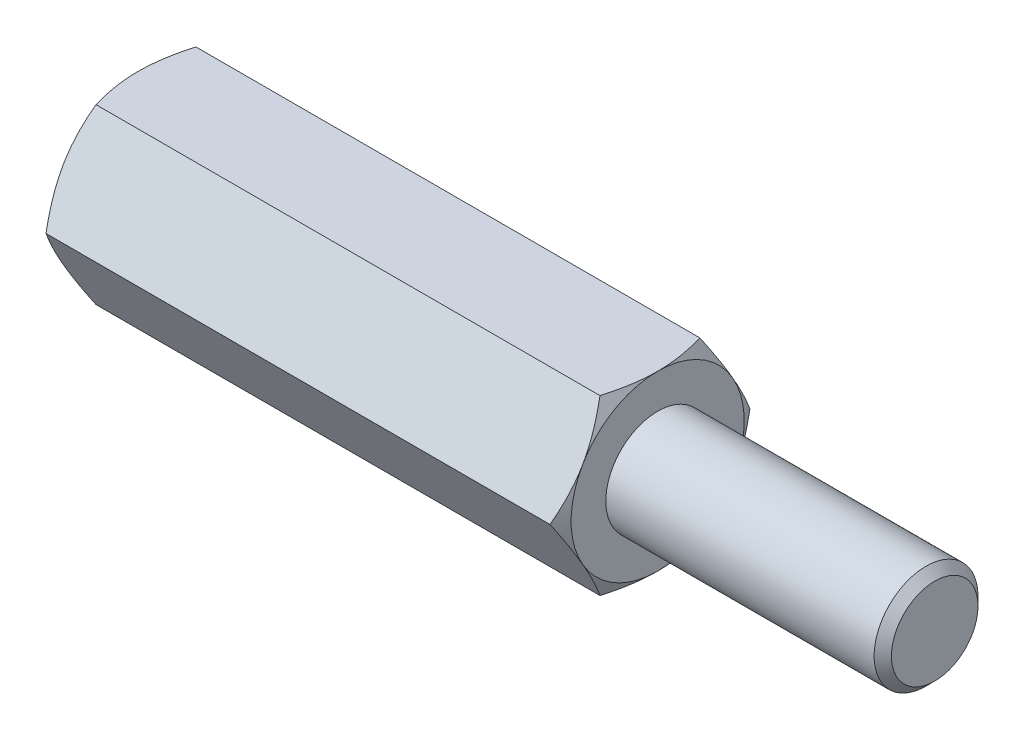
ISO-10303-21;
HEADER;
FILE_DESCRIPTION(('STEP AP214'),'2;1');
FILE_NAME('part.step','',(''),(''),'','','');
FILE_SCHEMA(('AUTOMOTIVE_DESIGN { 1 0 10303 214 1 1 1 1 }'));
ENDSEC;
DATA;
#1=APPLICATION_CONTEXT('core data for automotive mechanical design processes');
#2=APPLICATION_PROTOCOL_DEFINITION('international standard','automotive_design',2000,#1);
#3=PRODUCT_CONTEXT('',#1,'mechanical');
#4=PRODUCT('Part','Part','',(#3));
#5=PRODUCT_RELATED_PRODUCT_CATEGORY('part','',(#4));
#6=PRODUCT_DEFINITION_FORMATION('','',#4);
#7=PRODUCT_DEFINITION_CONTEXT('part definition',#1,'design');
#8=PRODUCT_DEFINITION('design','',#6,#7);
#9=PRODUCT_DEFINITION_SHAPE('','',#8);
#10=(LENGTH_UNIT() NAMED_UNIT(*) SI_UNIT(.MILLI.,.METRE.));
#11=(NAMED_UNIT(*) PLANE_ANGLE_UNIT() SI_UNIT($,.RADIAN.));
#12=(NAMED_UNIT(*) SI_UNIT($,.STERADIAN.) SOLID_ANGLE_UNIT());
#13=UNCERTAINTY_MEASURE_WITH_UNIT(LENGTH_MEASURE(1.E-05),#10,'distance_accuracy_value','');
#14=(GEOMETRIC_REPRESENTATION_CONTEXT(3) GLOBAL_UNCERTAINTY_ASSIGNED_CONTEXT((#13)) GLOBAL_UNIT_ASSIGNED_CONTEXT((#10,
#11,#12)) REPRESENTATION_CONTEXT('',''));
#15=CARTESIAN_POINT('',(0.,0.,0.));
#16=DIRECTION('',(0.,0.,1.));
#17=DIRECTION('',(1.,0.,0.));
#18=AXIS2_PLACEMENT_3D('',#15,#16,#17);
#19=CARTESIAN_POINT('',(7.5,2.5,-1.44337567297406));
#20=DIRECTION('',(1.,0.,0.));
#21=DIRECTION('',(0.,0.,-1.));
#22=AXIS2_PLACEMENT_3D('',#19,#20,#21);
#23=PLANE('',#22);
#24=CARTESIAN_POINT('',(7.5,0.,0.));
#25=DIRECTION('',(1.,0.,0.));
#26=DIRECTION('',(0.,0.,-1.));
#27=AXIS2_PLACEMENT_3D('',#24,#25,#26);
#28=CIRCLE('',#27,2.5);
#29=CARTESIAN_POINT('',(7.5,-1.25,-2.1650635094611));
#30=VERTEX_POINT('',#29);
#31=CARTESIAN_POINT('',(7.5,1.25,-2.1650635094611));
#32=VERTEX_POINT('',#31);
#33=EDGE_CURVE('E288',#30,#32,#28,.T.);
#34=ORIENTED_EDGE('',*,*,#33,.T.);
#35=CARTESIAN_POINT('',(7.5,2.5,0.));
#36=VERTEX_POINT('',#35);
#37=EDGE_CURVE('E53',#32,#36,#28,.T.);
#38=ORIENTED_EDGE('',*,*,#37,.T.);
#39=CARTESIAN_POINT('',(7.5,1.25,2.1650635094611));
#40=VERTEX_POINT('',#39);
#41=EDGE_CURVE('E295',#36,#40,#28,.T.);
#42=ORIENTED_EDGE('',*,*,#41,.T.);
#43=CARTESIAN_POINT('',(7.5,-1.25,2.1650635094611));
#44=VERTEX_POINT('',#43);
#45=EDGE_CURVE('E301',#40,#44,#28,.T.);
#46=ORIENTED_EDGE('',*,*,#45,.T.);
#47=CARTESIAN_POINT('',(7.5,0.,0.));
#48=DIRECTION('',(-1.,0.,0.));
#49=DIRECTION('',(0.,-1.,0.));
#50=AXIS2_PLACEMENT_3D('',#47,#48,#49);
#51=CIRCLE('',#50,2.5);
#52=CARTESIAN_POINT('',(7.5,-2.5,0.));
#53=VERTEX_POINT('',#52);
#54=EDGE_CURVE('E193',#53,#44,#51,.T.);
#55=ORIENTED_EDGE('',*,*,#54,.F.);
#56=EDGE_CURVE('E61',#53,#30,#28,.T.);
#57=ORIENTED_EDGE('',*,*,#56,.T.);
#58=EDGE_LOOP('',(#34,#38,#42,#46,#55,#57));
#59=FACE_BOUND('',#58,.T.);
#60=CARTESIAN_POINT('',(7.5,0.,0.));
#61=DIRECTION('',(1.,0.,0.));
#62=DIRECTION('',(0.,0.,-1.));
#63=AXIS2_PLACEMENT_3D('',#60,#61,#62);
#64=CIRCLE('',#63,1.5);
#65=CARTESIAN_POINT('',(7.5,0.,-1.5));
#66=VERTEX_POINT('',#65);
#67=EDGE_CURVE('E312',#66,#66,#64,.T.);
#68=ORIENTED_EDGE('',*,*,#67,.F.);
#69=EDGE_LOOP('',(#68));
#70=FACE_BOUND('',#69,.T.);
#71=ADVANCED_FACE('F37',(#59,#70),#23,.T.);
#72=CARTESIAN_POINT('',(7.5,0.,-2.88675134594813));
#73=DIRECTION('',(0.,-0.5,0.866025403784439));
#74=DIRECTION('',(0.,-0.866025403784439,-0.5));
#75=AXIS2_PLACEMENT_3D('',#72,#73,#74);
#76=PLANE('',#75);
#77=CARTESIAN_POINT('',(7.27664233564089,-0.000199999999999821,-2.88686681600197));
#78=CARTESIAN_POINT('',(7.31327837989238,0.109663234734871,-2.82343724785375));
#79=CARTESIAN_POINT('',(7.34659778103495,0.220474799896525,-2.75946016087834));
#80=CARTESIAN_POINT('',(7.40475771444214,0.444016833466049,-2.63039810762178));
#81=CARTESIAN_POINT('',(7.42957767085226,0.556751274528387,-2.5653108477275));
#82=CARTESIAN_POINT('',(7.46821434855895,0.780822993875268,-2.43594298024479));
#83=CARTESIAN_POINT('',(7.48228820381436,0.892125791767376,-2.37168227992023));
#84=CARTESIAN_POINT('',(7.49909084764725,1.11525522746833,-2.24285844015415));
#85=CARTESIAN_POINT('',(7.50183354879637,1.22708105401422,-2.17829576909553));
#86=CARTESIAN_POINT('',(7.49613423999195,1.43604197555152,-2.05765212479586));
#87=CARTESIAN_POINT('',(7.48909160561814,1.53320831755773,-2.0015531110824));
#88=CARTESIAN_POINT('',(7.46676858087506,1.726907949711,-1.88972057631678));
#89=CARTESIAN_POINT('',(7.45148056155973,1.82344056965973,-1.8339874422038));
#90=CARTESIAN_POINT('',(7.41326090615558,2.01753972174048,-1.7219242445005));
#91=CARTESIAN_POINT('',(7.39016722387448,2.11508168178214,-1.66560836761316));
#92=CARTESIAN_POINT('',(7.33775334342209,2.30871060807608,-1.55381665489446));
#93=CARTESIAN_POINT('',(7.30844546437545,2.40480005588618,-1.49833938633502));
#94=CARTESIAN_POINT('',(7.27664233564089,2.5002,-1.44326020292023));
#95=B_SPLINE_CURVE_WITH_KNOTS('',3,(#77,#78,#79,#80,#81,#82,#83,#84,#85,#86,#87,#88,#89,#90,#91,
#92,#93,#94),.UNSPECIFIED.,.F.,.F.,(4,2,2,2,2,2,2,2,4),(0.,0.396285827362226,0.79352433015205,
1.18093086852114,1.56786160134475,1.90479741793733,2.24204551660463,2.58677531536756,
2.93082800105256),.UNSPECIFIED.);
#96=CARTESIAN_POINT('',(7.2767090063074,0.,-2.88675134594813));
#97=VERTEX_POINT('',#96);
#98=EDGE_CURVE('E398',#97,#32,#95,.T.);
#99=ORIENTED_EDGE('',*,*,#98,.F.);
#100=DIRECTION('',(-1.,0.,0.));
#101=VECTOR('',#100,1.);
#102=CARTESIAN_POINT('',(7.5,0.,-2.88675134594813));
#103=LINE('',#102,#101);
#104=CARTESIAN_POINT('',(-7.2767090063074,0.,-2.88675134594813));
#105=VERTEX_POINT('',#104);
#106=EDGE_CURVE('E264',#97,#105,#103,.T.);
#107=ORIENTED_EDGE('',*,*,#106,.T.);
#108=CARTESIAN_POINT('',(-7.27664233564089,2.5002,-1.44326020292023));
#109=CARTESIAN_POINT('',(-7.31327837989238,2.39033676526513,-1.50668977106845));
#110=CARTESIAN_POINT('',(-7.34659778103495,2.27952520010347,-1.57066685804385));
#111=CARTESIAN_POINT('',(-7.40475771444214,2.05598316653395,-1.69972891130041));
#112=CARTESIAN_POINT('',(-7.42957767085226,1.94324872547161,-1.7648161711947));
#113=CARTESIAN_POINT('',(-7.46821434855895,1.71917700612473,-1.8941840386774));
#114=CARTESIAN_POINT('',(-7.48228820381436,1.60787420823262,-1.95844473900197));
#115=CARTESIAN_POINT('',(-7.49909084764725,1.38474477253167,-2.08726857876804));
#116=CARTESIAN_POINT('',(-7.50183354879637,1.27291894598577,-2.15183124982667));
#117=CARTESIAN_POINT('',(-7.49613423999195,1.06395802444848,-2.27247489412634));
#118=CARTESIAN_POINT('',(-7.48909160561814,0.96679168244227,-2.32857390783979));
#119=CARTESIAN_POINT('',(-7.46676858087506,0.773092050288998,-2.44040644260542));
#120=CARTESIAN_POINT('',(-7.45148056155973,0.676559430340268,-2.49613957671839));
#121=CARTESIAN_POINT('',(-7.41326090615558,0.482460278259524,-2.60820277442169));
#122=CARTESIAN_POINT('',(-7.39016722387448,0.38491831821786,-2.66451865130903));
#123=CARTESIAN_POINT('',(-7.33775334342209,0.191289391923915,-2.77631036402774));
#124=CARTESIAN_POINT('',(-7.30844546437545,0.0951999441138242,-2.83178763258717));
#125=CARTESIAN_POINT('',(-7.27664233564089,-0.000199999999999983,-2.88686681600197));
#126=B_SPLINE_CURVE_WITH_KNOTS('',3,(#108,#109,#110,#111,#112,#113,#114,#115,#116,#117,#118,
#119,#120,#121,#122,#123,#124,#125),.UNSPECIFIED.,.F.,.F.,(4,2,2,2,2,2,2,2,4),(0.,
0.396285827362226,0.79352433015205,1.18093086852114,1.56786160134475,1.90479741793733,
2.24204551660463,2.58677531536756,2.93082800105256),.UNSPECIFIED.);
#127=CARTESIAN_POINT('',(-7.5,1.25,-2.1650635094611));
#128=VERTEX_POINT('',#127);
#129=EDGE_CURVE('E377',#128,#105,#126,.T.);
#130=ORIENTED_EDGE('',*,*,#129,.F.);
#131=CARTESIAN_POINT('',(-7.2767090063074,2.5,-1.44337567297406));
#132=VERTEX_POINT('',#131);
#133=EDGE_CURVE('E317',#132,#128,#126,.T.);
#134=ORIENTED_EDGE('',*,*,#133,.F.);
#135=DIRECTION('',(-1.,0.,0.));
#136=VECTOR('',#135,1.);
#137=CARTESIAN_POINT('',(7.5,2.5,-1.44337567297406));
#138=LINE('',#137,#136);
#139=CARTESIAN_POINT('',(7.27670900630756,2.5,-1.44337567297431));
#140=VERTEX_POINT('',#139);
#141=EDGE_CURVE('E279',#140,#132,#138,.T.);
#142=ORIENTED_EDGE('',*,*,#141,.F.);
#143=EDGE_CURVE('E229',#32,#140,#95,.T.);
#144=ORIENTED_EDGE('',*,*,#143,.F.);
#145=EDGE_LOOP('',(#99,#107,#130,#134,#142,#144));
#146=FACE_BOUND('',#145,.T.);
#147=ADVANCED_FACE('F148',(#146),#76,.F.);
#148=CARTESIAN_POINT('',(7.5,2.5,-1.44337567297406));
#149=DIRECTION('',(0.,-1.,0.));
#150=DIRECTION('',(0.,0.,-1.));
#151=AXIS2_PLACEMENT_3D('',#148,#149,#150);
#152=PLANE('',#151);
#153=CARTESIAN_POINT('',(6.26803388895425,2.5,-3.90158441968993));
#154=CARTESIAN_POINT('',(6.32120772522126,2.5,-3.79217004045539));
#155=CARTESIAN_POINT('',(6.37387869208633,2.5,-3.68250707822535));
#156=CARTESIAN_POINT('',(6.47793249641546,2.5,-3.46255185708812));
#157=CARTESIAN_POINT('',(6.52931513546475,2.5,-3.35225950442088));
#158=CARTESIAN_POINT('',(6.63076309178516,2.5,-3.130356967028));
#159=CARTESIAN_POINT('',(6.68081992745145,2.5,-3.01874289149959));
#160=CARTESIAN_POINT('',(6.77891712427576,2.5,-2.79463535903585));
#161=CARTESIAN_POINT('',(6.82695757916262,2.5,-2.68214194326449));
#162=CARTESIAN_POINT('',(6.92201845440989,2.5,-2.45240385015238));
#163=CARTESIAN_POINT('',(6.96895431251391,2.5,-2.33512399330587));
#164=CARTESIAN_POINT('',(7.05933269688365,2.5,-2.09920133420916));
#165=CARTESIAN_POINT('',(7.10277483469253,2.5,-1.98055838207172));
#166=CARTESIAN_POINT('',(7.18504351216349,2.5,-1.74193489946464));
#167=CARTESIAN_POINT('',(7.22387917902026,2.5,-1.6219575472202));
#168=CARTESIAN_POINT('',(7.29570507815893,2.5,-1.38028205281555));
#169=CARTESIAN_POINT('',(7.32869712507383,2.5,-1.25858445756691));
#170=CARTESIAN_POINT('',(7.38709594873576,2.5,-1.01406369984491));
#171=CARTESIAN_POINT('',(7.41254379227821,2.5,-0.891250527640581));
#172=CARTESIAN_POINT('',(7.45442751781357,2.5,-0.64407172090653));
#173=CARTESIAN_POINT('',(7.47086432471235,2.5,-0.519706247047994));
#174=CARTESIAN_POINT('',(7.4932006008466,2.5,-0.271679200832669));
#175=CARTESIAN_POINT('',(7.49923751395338,2.5,-0.148030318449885));
#176=CARTESIAN_POINT('',(7.50062561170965,2.5,0.0993395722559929));
#177=CARTESIAN_POINT('',(7.49597656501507,2.5,0.223060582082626));
#178=CARTESIAN_POINT('',(7.47940443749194,2.5,0.432351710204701));
#179=CARTESIAN_POINT('',(7.47010665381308,2.5,0.518143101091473));
#180=CARTESIAN_POINT('',(7.44693847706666,2.5,0.689112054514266));
#181=CARTESIAN_POINT('',(7.43306748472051,2.5,0.774289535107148));
#182=CARTESIAN_POINT('',(7.38532020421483,2.5,1.02876599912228));
#183=CARTESIAN_POINT('',(7.34531764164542,2.5,1.19691958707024));
#184=CARTESIAN_POINT('',(7.25226567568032,2.5,1.53362893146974));
#185=CARTESIAN_POINT('',(7.19893620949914,2.5,1.70210423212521));
#186=CARTESIAN_POINT('',(7.11237169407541,2.5,1.95247339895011));
#187=CARTESIAN_POINT('',(7.08242477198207,2.5,2.03553184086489));
#188=CARTESIAN_POINT('',(7.02068409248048,2.5,2.20095860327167));
#189=CARTESIAN_POINT('',(6.98889037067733,2.5,2.2833269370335));
#190=CARTESIAN_POINT('',(6.90401426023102,2.5,2.49723312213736));
#191=CARTESIAN_POINT('',(6.84971733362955,2.5,2.6282879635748));
#192=CARTESIAN_POINT('',(6.73812739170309,2.5,2.88912034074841));
#193=CARTESIAN_POINT('',(6.6808341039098,2.5,3.01889775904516));
#194=CARTESIAN_POINT('',(6.56393487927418,2.5,3.27745045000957));
#195=CARTESIAN_POINT('',(6.50432825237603,2.5,3.40622540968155));
#196=CARTESIAN_POINT('',(6.38332345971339,2.5,3.66293235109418));
#197=CARTESIAN_POINT('',(6.32192524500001,2.5,3.79086430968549));
#198=CARTESIAN_POINT('',(6.1354580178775,2.5,4.17399495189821));
#199=CARTESIAN_POINT('',(6.00828249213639,2.5,4.42816724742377));
#200=CARTESIAN_POINT('',(5.75034557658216,2.5,4.93461464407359));
#201=CARTESIAN_POINT('',(5.61958483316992,2.5,5.18689007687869));
#202=CARTESIAN_POINT('',(5.36871001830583,2.5,5.66512451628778));
#203=CARTESIAN_POINT('',(5.24882986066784,2.5,5.89120644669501));
#204=CARTESIAN_POINT('',(5.00759021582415,2.5,6.34259369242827));
#205=CARTESIAN_POINT('',(4.88623065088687,2.5,6.56789896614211));
#206=CARTESIAN_POINT('',(4.64278038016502,2.5,7.01722044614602));
#207=CARTESIAN_POINT('',(4.52069305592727,2.5,7.24123848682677));
#208=CARTESIAN_POINT('',(4.27566624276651,2.5,7.68878772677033));
#209=CARTESIAN_POINT('',(4.15272681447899,2.5,7.9123189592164));
#210=CARTESIAN_POINT('',(4.02947566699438,2.5,8.13567697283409));
#211=B_SPLINE_CURVE_WITH_KNOTS('',3,(#153,#154,#155,#156,#157,#158,#159,#160,#161,#162,#163,
#164,#165,#166,#167,#168,#169,#170,#171,#172,#173,#174,#175,#176,#177,#178,#179,#180,#181,#182,
#183,#184,#185,#186,#187,#188,#189,#190,#191,#192,#193,#194,#195,#196,#197,#198,#199,#200,#201,
#202,#203,#204,#205,#206,#207,#208,#209,#210),.UNSPECIFIED.,.F.,.F.,(4,2,2,2,2,2,2,2,2,2,2,2,2,
2,2,2,2,2,2,2,2,2,2,2,2,2,2,2,4),(0.,0.364957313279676,0.729970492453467,1.09692930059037,
1.46387103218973,1.84279746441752,2.22176597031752,2.59997058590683,2.97805755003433,
3.35404692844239,3.72999770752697,4.10094071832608,4.47189175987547,4.73064905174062,
4.98944026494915,5.5072907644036,6.03710483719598,6.30196454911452,6.56681915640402,
6.99233818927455,7.41789598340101,7.84358170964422,8.26927907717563,9.12186602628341,
9.9743002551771,10.7419897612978,11.5097197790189,12.2750964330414,13.0404191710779),.UNSPECIFIED.);
#212=EDGE_CURVE('E227',#140,#36,#211,.T.);
#213=ORIENTED_EDGE('',*,*,#212,.F.);
#214=ORIENTED_EDGE('',*,*,#141,.T.);
#215=CARTESIAN_POINT('',(-6.26803388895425,2.5,-3.90158441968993));
#216=CARTESIAN_POINT('',(-6.32120772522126,2.5,-3.79217004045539));
#217=CARTESIAN_POINT('',(-6.37387869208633,2.5,-3.68250707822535));
#218=CARTESIAN_POINT('',(-6.47793249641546,2.5,-3.46255185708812));
#219=CARTESIAN_POINT('',(-6.52931513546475,2.5,-3.35225950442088));
#220=CARTESIAN_POINT('',(-6.63076309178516,2.5,-3.130356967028));
#221=CARTESIAN_POINT('',(-6.68081992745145,2.5,-3.01874289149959));
#222=CARTESIAN_POINT('',(-6.77891712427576,2.5,-2.79463535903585));
#223=CARTESIAN_POINT('',(-6.82695757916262,2.5,-2.68214194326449));
#224=CARTESIAN_POINT('',(-6.92201845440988,2.5,-2.45240385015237));
#225=CARTESIAN_POINT('',(-6.96895431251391,2.5,-2.33512399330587));
#226=CARTESIAN_POINT('',(-7.05933269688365,2.5,-2.09920133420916));
#227=CARTESIAN_POINT('',(-7.10277483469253,2.5,-1.98055838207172));
#228=CARTESIAN_POINT('',(-7.18504351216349,2.5,-1.74193489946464));
#229=CARTESIAN_POINT('',(-7.22387917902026,2.5,-1.6219575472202));
#230=CARTESIAN_POINT('',(-7.29570507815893,2.5,-1.38028205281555));
#231=CARTESIAN_POINT('',(-7.32869712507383,2.5,-1.25858445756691));
#232=CARTESIAN_POINT('',(-7.38709594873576,2.5,-1.01406369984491));
#233=CARTESIAN_POINT('',(-7.41254379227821,2.5,-0.891250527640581));
#234=CARTESIAN_POINT('',(-7.45442751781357,2.5,-0.64407172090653));
#235=CARTESIAN_POINT('',(-7.47086432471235,2.5,-0.519706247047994));
#236=CARTESIAN_POINT('',(-7.4932006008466,2.5,-0.271679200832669));
#237=CARTESIAN_POINT('',(-7.49923751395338,2.5,-0.148030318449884));
#238=CARTESIAN_POINT('',(-7.50062561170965,2.5,0.0993395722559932));
#239=CARTESIAN_POINT('',(-7.49597656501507,2.5,0.223060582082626));
#240=CARTESIAN_POINT('',(-7.47940443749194,2.5,0.432351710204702));
#241=CARTESIAN_POINT('',(-7.47010665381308,2.5,0.518143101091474));
#242=CARTESIAN_POINT('',(-7.44693847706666,2.5,0.689112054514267));
#243=CARTESIAN_POINT('',(-7.43306748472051,2.5,0.774289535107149));
#244=CARTESIAN_POINT('',(-7.38532020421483,2.5,1.02876599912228));
#245=CARTESIAN_POINT('',(-7.34531764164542,2.5,1.19691958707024));
#246=CARTESIAN_POINT('',(-7.25226567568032,2.5,1.53362893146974));
#247=CARTESIAN_POINT('',(-7.19893620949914,2.5,1.70210423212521));
#248=CARTESIAN_POINT('',(-7.11237169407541,2.5,1.95247339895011));
#249=CARTESIAN_POINT('',(-7.08242477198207,2.5,2.03553184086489));
#250=CARTESIAN_POINT('',(-7.02068409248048,2.5,2.20095860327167));
#251=CARTESIAN_POINT('',(-6.98889037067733,2.5,2.2833269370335));
#252=CARTESIAN_POINT('',(-6.90401426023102,2.5,2.49723312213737));
#253=CARTESIAN_POINT('',(-6.84971733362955,2.5,2.6282879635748));
#254=CARTESIAN_POINT('',(-6.73812739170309,2.5,2.88912034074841));
#255=CARTESIAN_POINT('',(-6.6808341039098,2.5,3.01889775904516));
#256=CARTESIAN_POINT('',(-6.56393487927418,2.5,3.27745045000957));
#257=CARTESIAN_POINT('',(-6.50432825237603,2.5,3.40622540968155));
#258=CARTESIAN_POINT('',(-6.38332345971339,2.5,3.66293235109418));
#259=CARTESIAN_POINT('',(-6.32192524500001,2.5,3.79086430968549));
#260=CARTESIAN_POINT('',(-6.1354580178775,2.5,4.17399495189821));
#261=CARTESIAN_POINT('',(-6.00828249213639,2.5,4.42816724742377));
#262=CARTESIAN_POINT('',(-5.75034557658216,2.5,4.93461464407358));
#263=CARTESIAN_POINT('',(-5.61958483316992,2.5,5.18689007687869));
#264=CARTESIAN_POINT('',(-5.36871001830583,2.5,5.66512451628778));
#265=CARTESIAN_POINT('',(-5.24882986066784,2.5,5.89120644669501));
#266=CARTESIAN_POINT('',(-5.00759021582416,2.5,6.34259369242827));
#267=CARTESIAN_POINT('',(-4.88623065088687,2.5,6.5678989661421));
#268=CARTESIAN_POINT('',(-4.64278038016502,2.5,7.01722044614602));
#269=CARTESIAN_POINT('',(-4.52069305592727,2.5,7.24123848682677));
#270=CARTESIAN_POINT('',(-4.27566624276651,2.5,7.68878772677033));
#271=CARTESIAN_POINT('',(-4.15272681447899,2.5,7.9123189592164));
#272=CARTESIAN_POINT('',(-4.02947566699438,2.5,8.13567697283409));
#273=B_SPLINE_CURVE_WITH_KNOTS('',3,(#215,#216,#217,#218,#219,#220,#221,#222,#223,#224,#225,
#226,#227,#228,#229,#230,#231,#232,#233,#234,#235,#236,#237,#238,#239,#240,#241,#242,#243,#244,
#245,#246,#247,#248,#249,#250,#251,#252,#253,#254,#255,#256,#257,#258,#259,#260,#261,#262,#263,
#264,#265,#266,#267,#268,#269,#270,#271,#272),.UNSPECIFIED.,.F.,.F.,(4,2,2,2,2,2,2,2,2,2,2,2,2,
2,2,2,2,2,2,2,2,2,2,2,2,2,2,2,4),(0.,0.364957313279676,0.729970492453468,1.09692930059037,
1.46387103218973,1.84279746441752,2.22176597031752,2.59997058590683,2.97805755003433,
3.35404692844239,3.72999770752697,4.10094071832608,4.47189175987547,4.73064905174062,
4.98944026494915,5.5072907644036,6.03710483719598,6.30196454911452,6.56681915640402,
6.99233818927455,7.41789598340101,7.84358170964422,8.26927907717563,9.12186602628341,
9.97430025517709,10.7419897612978,11.5097197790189,12.2750964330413,13.0404191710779),.UNSPECIFIED.);
#274=CARTESIAN_POINT('',(-7.5,2.5,0.));
#275=VERTEX_POINT('',#274);
#276=EDGE_CURVE('E241',#275,#132,#273,.F.);
#277=ORIENTED_EDGE('',*,*,#276,.F.);
#278=CARTESIAN_POINT('',(-7.2767090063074,2.5,1.44337567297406));
#279=VERTEX_POINT('',#278);
#280=EDGE_CURVE('E249',#279,#275,#273,.F.);
#281=ORIENTED_EDGE('',*,*,#280,.F.);
#282=DIRECTION('',(-1.,0.,0.));
#283=VECTOR('',#282,1.);
#284=CARTESIAN_POINT('',(7.5,2.5,1.44337567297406));
#285=LINE('',#284,#283);
#286=CARTESIAN_POINT('',(7.2767090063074,2.5,1.44337567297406));
#287=VERTEX_POINT('',#286);
#288=EDGE_CURVE('E276',#287,#279,#285,.T.);
#289=ORIENTED_EDGE('',*,*,#288,.F.);
#290=EDGE_CURVE('E221',#36,#287,#211,.T.);
#291=ORIENTED_EDGE('',*,*,#290,.F.);
#292=EDGE_LOOP('',(#213,#214,#277,#281,#289,#291));
#293=FACE_BOUND('',#292,.T.);
#294=ADVANCED_FACE('F153',(#293),#152,.F.);
#295=CARTESIAN_POINT('',(7.5,2.5,1.44337567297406));
#296=DIRECTION('',(0.,-0.5,-0.866025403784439));
#297=DIRECTION('',(0.,0.866025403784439,-0.5));
#298=AXIS2_PLACEMENT_3D('',#295,#296,#297);
#299=PLANE('',#298);
#300=CARTESIAN_POINT('',(7.27664233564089,2.5002,1.44326020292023));
#301=CARTESIAN_POINT('',(7.31327837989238,2.39033676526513,1.50668977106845));
#302=CARTESIAN_POINT('',(7.34659778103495,2.27952520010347,1.57066685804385));
#303=CARTESIAN_POINT('',(7.40475771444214,2.05598316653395,1.69972891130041));
#304=CARTESIAN_POINT('',(7.42957767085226,1.94324872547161,1.7648161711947));
#305=CARTESIAN_POINT('',(7.46821434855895,1.71917700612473,1.8941840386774));
#306=CARTESIAN_POINT('',(7.48228820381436,1.60787420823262,1.95844473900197));
#307=CARTESIAN_POINT('',(7.49909084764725,1.38474477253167,2.08726857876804));
#308=CARTESIAN_POINT('',(7.50183354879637,1.27291894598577,2.15183124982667));
#309=CARTESIAN_POINT('',(7.49613423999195,1.06395802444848,2.27247489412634));
#310=CARTESIAN_POINT('',(7.48909160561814,0.96679168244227,2.32857390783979));
#311=CARTESIAN_POINT('',(7.46676858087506,0.773092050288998,2.44040644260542));
#312=CARTESIAN_POINT('',(7.45148056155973,0.676559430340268,2.49613957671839));
#313=CARTESIAN_POINT('',(7.41326090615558,0.482460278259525,2.60820277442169));
#314=CARTESIAN_POINT('',(7.39016722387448,0.38491831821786,2.66451865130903));
#315=CARTESIAN_POINT('',(7.33775334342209,0.191289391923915,2.77631036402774));
#316=CARTESIAN_POINT('',(7.30844546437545,0.0951999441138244,2.83178763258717));
#317=CARTESIAN_POINT('',(7.27664233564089,-0.000199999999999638,2.88686681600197));
#318=B_SPLINE_CURVE_WITH_KNOTS('',3,(#300,#301,#302,#303,#304,#305,#306,#307,#308,#309,#310,
#311,#312,#313,#314,#315,#316,#317),.UNSPECIFIED.,.F.,.F.,(4,2,2,2,2,2,2,2,4),(0.,
0.396285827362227,0.79352433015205,1.18093086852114,1.56786160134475,1.90479741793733,
2.24204551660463,2.58677531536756,2.93082800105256),.UNSPECIFIED.);
#319=EDGE_CURVE('E228',#287,#40,#318,.T.);
#320=ORIENTED_EDGE('',*,*,#319,.F.);
#321=ORIENTED_EDGE('',*,*,#288,.T.);
#322=CARTESIAN_POINT('',(-7.27664233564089,-0.000199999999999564,2.88686681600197));
#323=CARTESIAN_POINT('',(-7.31327837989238,0.109663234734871,2.82343724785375));
#324=CARTESIAN_POINT('',(-7.34659778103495,0.220474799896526,2.75946016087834));
#325=CARTESIAN_POINT('',(-7.40475771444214,0.44401683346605,2.63039810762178));
#326=CARTESIAN_POINT('',(-7.42957767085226,0.556751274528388,2.5653108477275));
#327=CARTESIAN_POINT('',(-7.46821434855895,0.780822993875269,2.43594298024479));
#328=CARTESIAN_POINT('',(-7.48228820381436,0.892125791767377,2.37168227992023));
#329=CARTESIAN_POINT('',(-7.49909084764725,1.11525522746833,2.24285844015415));
#330=CARTESIAN_POINT('',(-7.50183354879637,1.22708105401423,2.17829576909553));
#331=CARTESIAN_POINT('',(-7.49613423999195,1.43604197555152,2.05765212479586));
#332=CARTESIAN_POINT('',(-7.48909160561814,1.53320831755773,2.0015531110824));
#333=CARTESIAN_POINT('',(-7.46676858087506,1.726907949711,1.88972057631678));
#334=CARTESIAN_POINT('',(-7.45148056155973,1.82344056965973,1.8339874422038));
#335=CARTESIAN_POINT('',(-7.41326090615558,2.01753972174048,1.7219242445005));
#336=CARTESIAN_POINT('',(-7.39016722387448,2.11508168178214,1.66560836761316));
#337=CARTESIAN_POINT('',(-7.33775334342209,2.30871060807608,1.55381665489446));
#338=CARTESIAN_POINT('',(-7.30844546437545,2.40480005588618,1.49833938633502));
#339=CARTESIAN_POINT('',(-7.27664233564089,2.5002,1.44326020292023));
#340=B_SPLINE_CURVE_WITH_KNOTS('',3,(#322,#323,#324,#325,#326,#327,#328,#329,#330,#331,#332,
#333,#334,#335,#336,#337,#338,#339),.UNSPECIFIED.,.F.,.F.,(4,2,2,2,2,2,2,2,4),(0.,
0.396285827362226,0.79352433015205,1.18093086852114,1.56786160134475,1.90479741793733,
2.24204551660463,2.58677531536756,2.93082800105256),.UNSPECIFIED.);
#341=CARTESIAN_POINT('',(-7.5,1.25,2.1650635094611));
#342=VERTEX_POINT('',#341);
#343=EDGE_CURVE('E255',#342,#279,#340,.T.);
#344=ORIENTED_EDGE('',*,*,#343,.F.);
#345=CARTESIAN_POINT('',(-7.2767090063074,0.,2.88675134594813));
#346=VERTEX_POINT('',#345);
#347=EDGE_CURVE('E262',#346,#342,#340,.T.);
#348=ORIENTED_EDGE('',*,*,#347,.F.);
#349=DIRECTION('',(-1.,0.,0.));
#350=VECTOR('',#349,1.);
#351=CARTESIAN_POINT('',(7.5,0.,2.88675134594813));
#352=LINE('',#351,#350);
#353=CARTESIAN_POINT('',(7.2767090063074,0.,2.88675134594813));
#354=VERTEX_POINT('',#353);
#355=EDGE_CURVE('E273',#354,#346,#352,.T.);
#356=ORIENTED_EDGE('',*,*,#355,.F.);
#357=EDGE_CURVE('E215',#40,#354,#318,.T.);
#358=ORIENTED_EDGE('',*,*,#357,.F.);
#359=EDGE_LOOP('',(#320,#321,#344,#348,#356,#358));
#360=FACE_BOUND('',#359,.T.);
#361=ADVANCED_FACE('F235',(#360),#299,.F.);
#362=CARTESIAN_POINT('',(7.5,0.,2.88675134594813));
#363=DIRECTION('',(0.,0.5,-0.866025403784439));
#364=DIRECTION('',(0.,0.866025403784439,0.5));
#365=AXIS2_PLACEMENT_3D('',#362,#363,#364);
#366=PLANE('',#365);
#367=CARTESIAN_POINT('',(7.27664233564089,0.000200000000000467,2.88686681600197));
#368=CARTESIAN_POINT('',(7.31327837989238,-0.109663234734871,2.82343724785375));
#369=CARTESIAN_POINT('',(7.34659778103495,-0.220474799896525,2.75946016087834));
#370=CARTESIAN_POINT('',(7.40475771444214,-0.444016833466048,2.63039810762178));
#371=CARTESIAN_POINT('',(7.42957767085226,-0.556751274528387,2.5653108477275));
#372=CARTESIAN_POINT('',(7.46821434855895,-0.780822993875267,2.43594298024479));
#373=CARTESIAN_POINT('',(7.48228820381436,-0.892125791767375,2.37168227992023));
#374=CARTESIAN_POINT('',(7.49909084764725,-1.11525522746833,2.24285844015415));
#375=CARTESIAN_POINT('',(7.50183354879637,-1.22708105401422,2.17829576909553));
#376=CARTESIAN_POINT('',(7.49613423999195,-1.43604197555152,2.05765212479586));
#377=CARTESIAN_POINT('',(7.48909160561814,-1.53320831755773,2.0015531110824));
#378=CARTESIAN_POINT('',(7.46676858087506,-1.726907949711,1.88972057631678));
#379=CARTESIAN_POINT('',(7.45148056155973,-1.82344056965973,1.8339874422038));
#380=CARTESIAN_POINT('',(7.41326090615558,-2.01753972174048,1.7219242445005));
#381=CARTESIAN_POINT('',(7.39016722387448,-2.11508168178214,1.66560836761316));
#382=CARTESIAN_POINT('',(7.33775334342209,-2.30871060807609,1.55381665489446));
#383=CARTESIAN_POINT('',(7.30844546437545,-2.40480005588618,1.49833938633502));
#384=CARTESIAN_POINT('',(7.27664233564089,-2.5002,1.44326020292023));
#385=B_SPLINE_CURVE_WITH_KNOTS('',3,(#367,#368,#369,#370,#371,#372,#373,#374,#375,#376,#377,
#378,#379,#380,#381,#382,#383,#384),.UNSPECIFIED.,.F.,.F.,(4,2,2,2,2,2,2,2,4),(0.,
0.396285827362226,0.793524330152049,1.18093086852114,1.56786160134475,1.90479741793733,
2.24204551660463,2.58677531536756,2.93082800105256),.UNSPECIFIED.);
#386=EDGE_CURVE('E321',#354,#44,#385,.T.);
#387=ORIENTED_EDGE('',*,*,#386,.F.);
#388=ORIENTED_EDGE('',*,*,#355,.T.);
#389=CARTESIAN_POINT('',(-7.27664233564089,-2.5002,1.44326020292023));
#390=CARTESIAN_POINT('',(-7.31327837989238,-2.39033676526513,1.50668977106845));
#391=CARTESIAN_POINT('',(-7.34659778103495,-2.27952520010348,1.57066685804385));
#392=CARTESIAN_POINT('',(-7.40475771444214,-2.05598316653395,1.69972891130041));
#393=CARTESIAN_POINT('',(-7.42957767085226,-1.94324872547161,1.7648161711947));
#394=CARTESIAN_POINT('',(-7.46821434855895,-1.71917700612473,1.8941840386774));
#395=CARTESIAN_POINT('',(-7.48228820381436,-1.60787420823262,1.95844473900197));
#396=CARTESIAN_POINT('',(-7.49909084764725,-1.38474477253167,2.08726857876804));
#397=CARTESIAN_POINT('',(-7.50183354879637,-1.27291894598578,2.15183124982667));
#398=CARTESIAN_POINT('',(-7.49613423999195,-1.06395802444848,2.27247489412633));
#399=CARTESIAN_POINT('',(-7.48909160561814,-0.966791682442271,2.32857390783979));
#400=CARTESIAN_POINT('',(-7.46676858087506,-0.773092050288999,2.44040644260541));
#401=CARTESIAN_POINT('',(-7.45148056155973,-0.676559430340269,2.49613957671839));
#402=CARTESIAN_POINT('',(-7.41326090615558,-0.482460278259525,2.60820277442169));
#403=CARTESIAN_POINT('',(-7.39016722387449,-0.38491831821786,2.66451865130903));
#404=CARTESIAN_POINT('',(-7.33775334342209,-0.191289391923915,2.77631036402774));
#405=CARTESIAN_POINT('',(-7.30844546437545,-0.0951999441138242,2.83178763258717));
#406=CARTESIAN_POINT('',(-7.27664233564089,0.000200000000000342,2.88686681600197));
#407=B_SPLINE_CURVE_WITH_KNOTS('',3,(#389,#390,#391,#392,#393,#394,#395,#396,#397,#398,#399,
#400,#401,#402,#403,#404,#405,#406),.UNSPECIFIED.,.F.,.F.,(4,2,2,2,2,2,2,2,4),(0.,
0.396285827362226,0.793524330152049,1.18093086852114,1.56786160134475,1.90479741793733,
2.24204551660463,2.58677531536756,2.93082800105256),.UNSPECIFIED.);
#408=CARTESIAN_POINT('',(-7.5,-1.25,2.1650635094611));
#409=VERTEX_POINT('',#408);
#410=EDGE_CURVE('E263',#409,#346,#407,.T.);
#411=ORIENTED_EDGE('',*,*,#410,.F.);
#412=CARTESIAN_POINT('',(-7.2767090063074,-2.5,1.44337567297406));
#413=VERTEX_POINT('',#412);
#414=EDGE_CURVE('E250',#413,#409,#407,.T.);
#415=ORIENTED_EDGE('',*,*,#414,.F.);
#416=DIRECTION('',(-1.,0.,0.));
#417=VECTOR('',#416,1.);
#418=CARTESIAN_POINT('',(7.5,-2.5,1.44337567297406));
#419=LINE('',#418,#417);
#420=CARTESIAN_POINT('',(7.2767090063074,-2.5,1.44337567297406));
#421=VERTEX_POINT('',#420);
#422=EDGE_CURVE('E270',#421,#413,#419,.T.);
#423=ORIENTED_EDGE('',*,*,#422,.F.);
#424=EDGE_CURVE('E210',#44,#421,#385,.T.);
#425=ORIENTED_EDGE('',*,*,#424,.F.);
#426=EDGE_LOOP('',(#387,#388,#411,#415,#423,#425));
#427=FACE_BOUND('',#426,.T.);
#428=ADVANCED_FACE('F338',(#427),#366,.F.);
#429=CARTESIAN_POINT('',(7.5,-2.5,1.44337567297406));
#430=DIRECTION('',(0.,1.,0.));
#431=DIRECTION('',(0.,0.,1.));
#432=AXIS2_PLACEMENT_3D('',#429,#430,#431);
#433=PLANE('',#432);
#434=CARTESIAN_POINT('',(6.26803388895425,-2.5,-3.90158441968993));
#435=CARTESIAN_POINT('',(6.32120772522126,-2.5,-3.79217004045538));
#436=CARTESIAN_POINT('',(6.37387869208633,-2.5,-3.68250707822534));
#437=CARTESIAN_POINT('',(6.47793249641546,-2.5,-3.46255185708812));
#438=CARTESIAN_POINT('',(6.52931513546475,-2.5,-3.35225950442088));
#439=CARTESIAN_POINT('',(6.63076309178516,-2.5,-3.130356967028));
#440=CARTESIAN_POINT('',(6.68081992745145,-2.5,-3.01874289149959));
#441=CARTESIAN_POINT('',(6.77891712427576,-2.5,-2.79463535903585));
#442=CARTESIAN_POINT('',(6.82695757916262,-2.5,-2.68214194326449));
#443=CARTESIAN_POINT('',(6.92201845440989,-2.5,-2.45240385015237));
#444=CARTESIAN_POINT('',(6.96895431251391,-2.5,-2.33512399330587));
#445=CARTESIAN_POINT('',(7.05933269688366,-2.5,-2.09920133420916));
#446=CARTESIAN_POINT('',(7.10277483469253,-2.5,-1.98055838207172));
#447=CARTESIAN_POINT('',(7.18504351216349,-2.5,-1.74193489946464));
#448=CARTESIAN_POINT('',(7.22387917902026,-2.5,-1.6219575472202));
#449=CARTESIAN_POINT('',(7.29570507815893,-2.5,-1.38028205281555));
#450=CARTESIAN_POINT('',(7.32869712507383,-2.5,-1.25858445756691));
#451=CARTESIAN_POINT('',(7.38709594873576,-2.5,-1.01406369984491));
#452=CARTESIAN_POINT('',(7.41254379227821,-2.5,-0.891250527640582));
#453=CARTESIAN_POINT('',(7.45442751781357,-2.5,-0.644071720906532));
#454=CARTESIAN_POINT('',(7.47086432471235,-2.5,-0.519706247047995));
#455=CARTESIAN_POINT('',(7.4932006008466,-2.5,-0.27167920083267));
#456=CARTESIAN_POINT('',(7.49923751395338,-2.5,-0.148030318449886));
#457=CARTESIAN_POINT('',(7.50062561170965,-2.5,0.0993395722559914));
#458=CARTESIAN_POINT('',(7.49597656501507,-2.5,0.223060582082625));
#459=CARTESIAN_POINT('',(7.47940443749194,-2.5,0.432351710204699));
#460=CARTESIAN_POINT('',(7.47010665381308,-2.5,0.518143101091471));
#461=CARTESIAN_POINT('',(7.44693847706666,-2.5,0.689112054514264));
#462=CARTESIAN_POINT('',(7.43306748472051,-2.5,0.774289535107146));
#463=CARTESIAN_POINT('',(7.38532020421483,-2.5,1.02876599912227));
#464=CARTESIAN_POINT('',(7.34531764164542,-2.5,1.19691958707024));
#465=CARTESIAN_POINT('',(7.25226567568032,-2.5,1.53362893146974));
#466=CARTESIAN_POINT('',(7.19893620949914,-2.5,1.70210423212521));
#467=CARTESIAN_POINT('',(7.11237169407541,-2.5,1.95247339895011));
#468=CARTESIAN_POINT('',(7.08242477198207,-2.5,2.03553184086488));
#469=CARTESIAN_POINT('',(7.02068409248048,-2.5,2.20095860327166));
#470=CARTESIAN_POINT('',(6.98889037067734,-2.5,2.28332693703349));
#471=CARTESIAN_POINT('',(6.90401426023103,-2.5,2.49723312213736));
#472=CARTESIAN_POINT('',(6.84971733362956,-2.5,2.6282879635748));
#473=CARTESIAN_POINT('',(6.7381273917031,-2.5,2.8891203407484));
#474=CARTESIAN_POINT('',(6.6808341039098,-2.5,3.01889775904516));
#475=CARTESIAN_POINT('',(6.56393487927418,-2.5,3.27745045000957));
#476=CARTESIAN_POINT('',(6.50432825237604,-2.5,3.40622540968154));
#477=CARTESIAN_POINT('',(6.3833234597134,-2.5,3.66293235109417));
#478=CARTESIAN_POINT('',(6.32192524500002,-2.5,3.79086430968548));
#479=CARTESIAN_POINT('',(6.1354580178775,-2.5,4.1739949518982));
#480=CARTESIAN_POINT('',(6.00828249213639,-2.5,4.42816724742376));
#481=CARTESIAN_POINT('',(5.75034557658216,-2.5,4.93461464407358));
#482=CARTESIAN_POINT('',(5.61958483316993,-2.5,5.18689007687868));
#483=CARTESIAN_POINT('',(5.36871001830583,-2.5,5.66512451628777));
#484=CARTESIAN_POINT('',(5.24882986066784,-2.5,5.891206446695));
#485=CARTESIAN_POINT('',(5.00759021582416,-2.5,6.34259369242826));
#486=CARTESIAN_POINT('',(4.88623065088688,-2.5,6.5678989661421));
#487=CARTESIAN_POINT('',(4.64278038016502,-2.5,7.01722044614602));
#488=CARTESIAN_POINT('',(4.52069305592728,-2.5,7.24123848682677));
#489=CARTESIAN_POINT('',(4.27566624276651,-2.5,7.68878772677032));
#490=CARTESIAN_POINT('',(4.15272681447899,-2.5,7.9123189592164));
#491=CARTESIAN_POINT('',(4.02947566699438,-2.5,8.13567697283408));
#492=B_SPLINE_CURVE_WITH_KNOTS('',3,(#434,#435,#436,#437,#438,#439,#440,#441,#442,#443,#444,
#445,#446,#447,#448,#449,#450,#451,#452,#453,#454,#455,#456,#457,#458,#459,#460,#461,#462,#463,
#464,#465,#466,#467,#468,#469,#470,#471,#472,#473,#474,#475,#476,#477,#478,#479,#480,#481,#482,
#483,#484,#485,#486,#487,#488,#489,#490,#491),.UNSPECIFIED.,.F.,.F.,(4,2,2,2,2,2,2,2,2,2,2,2,2,
2,2,2,2,2,2,2,2,2,2,2,2,2,2,2,4),(0.,0.364957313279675,0.729970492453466,1.09692930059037,
1.46387103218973,1.84279746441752,2.22176597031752,2.59997058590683,2.97805755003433,
3.35404692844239,3.72999770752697,4.10094071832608,4.47189175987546,4.73064905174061,
4.98944026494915,5.50729076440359,6.03710483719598,6.30196454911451,6.56681915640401,
6.99233818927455,7.417895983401,7.84358170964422,8.26927907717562,9.1218660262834,
9.97430025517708,10.7419897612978,11.5097197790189,12.2750964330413,13.0404191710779),.UNSPECIFIED.);
#493=EDGE_CURVE('E319',#421,#53,#492,.F.);
#494=ORIENTED_EDGE('',*,*,#493,.F.);
#495=ORIENTED_EDGE('',*,*,#422,.T.);
#496=CARTESIAN_POINT('',(-6.26803388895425,-2.5,-3.90158441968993));
#497=CARTESIAN_POINT('',(-6.32120772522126,-2.5,-3.79217004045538));
#498=CARTESIAN_POINT('',(-6.37387869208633,-2.5,-3.68250707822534));
#499=CARTESIAN_POINT('',(-6.47793249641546,-2.5,-3.46255185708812));
#500=CARTESIAN_POINT('',(-6.52931513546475,-2.5,-3.35225950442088));
#501=CARTESIAN_POINT('',(-6.63076309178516,-2.5,-3.130356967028));
#502=CARTESIAN_POINT('',(-6.68081992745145,-2.5,-3.01874289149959));
#503=CARTESIAN_POINT('',(-6.77891712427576,-2.5,-2.79463535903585));
#504=CARTESIAN_POINT('',(-6.82695757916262,-2.5,-2.68214194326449));
#505=CARTESIAN_POINT('',(-6.92201845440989,-2.5,-2.45240385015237));
#506=CARTESIAN_POINT('',(-6.96895431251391,-2.5,-2.33512399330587));
#507=CARTESIAN_POINT('',(-7.05933269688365,-2.5,-2.09920133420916));
#508=CARTESIAN_POINT('',(-7.10277483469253,-2.5,-1.98055838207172));
#509=CARTESIAN_POINT('',(-7.18504351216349,-2.5,-1.74193489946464));
#510=CARTESIAN_POINT('',(-7.22387917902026,-2.5,-1.6219575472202));
#511=CARTESIAN_POINT('',(-7.29570507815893,-2.5,-1.38028205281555));
#512=CARTESIAN_POINT('',(-7.32869712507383,-2.5,-1.25858445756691));
#513=CARTESIAN_POINT('',(-7.38709594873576,-2.5,-1.01406369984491));
#514=CARTESIAN_POINT('',(-7.41254379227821,-2.5,-0.891250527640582));
#515=CARTESIAN_POINT('',(-7.45442751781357,-2.5,-0.644071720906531));
#516=CARTESIAN_POINT('',(-7.47086432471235,-2.5,-0.519706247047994));
#517=CARTESIAN_POINT('',(-7.4932006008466,-2.5,-0.271679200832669));
#518=CARTESIAN_POINT('',(-7.49923751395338,-2.5,-0.148030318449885));
#519=CARTESIAN_POINT('',(-7.50062561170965,-2.5,0.0993395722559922));
#520=CARTESIAN_POINT('',(-7.49597656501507,-2.5,0.223060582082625));
#521=CARTESIAN_POINT('',(-7.47940443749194,-2.5,0.4323517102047));
#522=CARTESIAN_POINT('',(-7.47010665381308,-2.5,0.518143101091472));
#523=CARTESIAN_POINT('',(-7.44693847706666,-2.5,0.689112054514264));
#524=CARTESIAN_POINT('',(-7.43306748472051,-2.5,0.774289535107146));
#525=CARTESIAN_POINT('',(-7.38532020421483,-2.5,1.02876599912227));
#526=CARTESIAN_POINT('',(-7.34531764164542,-2.5,1.19691958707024));
#527=CARTESIAN_POINT('',(-7.25226567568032,-2.5,1.53362893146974));
#528=CARTESIAN_POINT('',(-7.19893620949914,-2.5,1.70210423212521));
#529=CARTESIAN_POINT('',(-7.11237169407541,-2.5,1.95247339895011));
#530=CARTESIAN_POINT('',(-7.08242477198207,-2.5,2.03553184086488));
#531=CARTESIAN_POINT('',(-7.02068409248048,-2.5,2.20095860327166));
#532=CARTESIAN_POINT('',(-6.98889037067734,-2.5,2.28332693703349));
#533=CARTESIAN_POINT('',(-6.90401426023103,-2.5,2.49723312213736));
#534=CARTESIAN_POINT('',(-6.84971733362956,-2.5,2.6282879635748));
#535=CARTESIAN_POINT('',(-6.7381273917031,-2.5,2.8891203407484));
#536=CARTESIAN_POINT('',(-6.6808341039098,-2.5,3.01889775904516));
#537=CARTESIAN_POINT('',(-6.56393487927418,-2.5,3.27745045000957));
#538=CARTESIAN_POINT('',(-6.50432825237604,-2.5,3.40622540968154));
#539=CARTESIAN_POINT('',(-6.3833234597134,-2.5,3.66293235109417));
#540=CARTESIAN_POINT('',(-6.32192524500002,-2.5,3.79086430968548));
#541=CARTESIAN_POINT('',(-6.1354580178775,-2.5,4.1739949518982));
#542=CARTESIAN_POINT('',(-6.00828249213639,-2.5,4.42816724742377));
#543=CARTESIAN_POINT('',(-5.75034557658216,-2.5,4.93461464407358));
#544=CARTESIAN_POINT('',(-5.61958483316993,-2.5,5.18689007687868));
#545=CARTESIAN_POINT('',(-5.36871001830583,-2.5,5.66512451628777));
#546=CARTESIAN_POINT('',(-5.24882986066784,-2.5,5.891206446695));
#547=CARTESIAN_POINT('',(-5.00759021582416,-2.5,6.34259369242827));
#548=CARTESIAN_POINT('',(-4.88623065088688,-2.5,6.5678989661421));
#549=CARTESIAN_POINT('',(-4.64278038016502,-2.5,7.01722044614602));
#550=CARTESIAN_POINT('',(-4.52069305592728,-2.5,7.24123848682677));
#551=CARTESIAN_POINT('',(-4.27566624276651,-2.5,7.68878772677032));
#552=CARTESIAN_POINT('',(-4.15272681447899,-2.5,7.9123189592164));
#553=CARTESIAN_POINT('',(-4.02947566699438,-2.5,8.13567697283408));
#554=B_SPLINE_CURVE_WITH_KNOTS('',3,(#496,#497,#498,#499,#500,#501,#502,#503,#504,#505,#506,
#507,#508,#509,#510,#511,#512,#513,#514,#515,#516,#517,#518,#519,#520,#521,#522,#523,#524,#525,
#526,#527,#528,#529,#530,#531,#532,#533,#534,#535,#536,#537,#538,#539,#540,#541,#542,#543,#544,
#545,#546,#547,#548,#549,#550,#551,#552,#553),.UNSPECIFIED.,.F.,.F.,(4,2,2,2,2,2,2,2,2,2,2,2,2,
2,2,2,2,2,2,2,2,2,2,2,2,2,2,2,4),(0.,0.364957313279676,0.729970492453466,1.09692930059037,
1.46387103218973,1.84279746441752,2.22176597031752,2.59997058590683,2.97805755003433,
3.35404692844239,3.72999770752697,4.10094071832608,4.47189175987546,4.73064905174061,
4.98944026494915,5.50729076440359,6.03710483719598,6.30196454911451,6.56681915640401,
6.99233818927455,7.417895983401,7.84358170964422,8.26927907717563,9.1218660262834,
9.97430025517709,10.7419897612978,11.5097197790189,12.2750964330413,13.0404191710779),.UNSPECIFIED.);
#555=CARTESIAN_POINT('',(-7.5,-2.5,0.));
#556=VERTEX_POINT('',#555);
#557=EDGE_CURVE('E314',#556,#413,#554,.T.);
#558=ORIENTED_EDGE('',*,*,#557,.F.);
#559=CARTESIAN_POINT('',(-7.2767090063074,-2.5,-1.44337567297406));
#560=VERTEX_POINT('',#559);
#561=EDGE_CURVE('E318',#560,#556,#554,.T.);
#562=ORIENTED_EDGE('',*,*,#561,.F.);
#563=DIRECTION('',(-1.,0.,0.));
#564=VECTOR('',#563,1.);
#565=CARTESIAN_POINT('',(7.5,-2.5,-1.44337567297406));
#566=LINE('',#565,#564);
#567=CARTESIAN_POINT('',(7.2767090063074,-2.5,-1.44337567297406));
#568=VERTEX_POINT('',#567);
#569=EDGE_CURVE('E267',#568,#560,#566,.T.);
#570=ORIENTED_EDGE('',*,*,#569,.F.);
#571=EDGE_CURVE('E195',#53,#568,#492,.F.);
#572=ORIENTED_EDGE('',*,*,#571,.F.);
#573=EDGE_LOOP('',(#494,#495,#558,#562,#570,#572));
#574=FACE_BOUND('',#573,.T.);
#575=ADVANCED_FACE('F172',(#574),#433,.F.);
#576=CARTESIAN_POINT('',(7.5,-2.5,-1.44337567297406));
#577=DIRECTION('',(0.,0.5,0.866025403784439));
#578=DIRECTION('',(0.,-0.866025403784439,0.5));
#579=AXIS2_PLACEMENT_3D('',#576,#577,#578);
#580=PLANE('',#579);
#581=CARTESIAN_POINT('',(7.27664233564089,-2.5002,-1.44326020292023));
#582=CARTESIAN_POINT('',(7.31327837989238,-2.39033676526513,-1.50668977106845));
#583=CARTESIAN_POINT('',(7.34659778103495,-2.27952520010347,-1.57066685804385));
#584=CARTESIAN_POINT('',(7.40475771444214,-2.05598316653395,-1.69972891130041));
#585=CARTESIAN_POINT('',(7.42957767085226,-1.94324872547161,-1.7648161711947));
#586=CARTESIAN_POINT('',(7.46821434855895,-1.71917700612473,-1.8941840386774));
#587=CARTESIAN_POINT('',(7.48228820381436,-1.60787420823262,-1.95844473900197));
#588=CARTESIAN_POINT('',(7.49909084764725,-1.38474477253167,-2.08726857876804));
#589=CARTESIAN_POINT('',(7.50183354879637,-1.27291894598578,-2.15183124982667));
#590=CARTESIAN_POINT('',(7.49613423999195,-1.06395802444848,-2.27247489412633));
#591=CARTESIAN_POINT('',(7.48909160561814,-0.966791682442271,-2.32857390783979));
#592=CARTESIAN_POINT('',(7.46676858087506,-0.773092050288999,-2.44040644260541));
#593=CARTESIAN_POINT('',(7.45148056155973,-0.676559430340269,-2.49613957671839));
#594=CARTESIAN_POINT('',(7.41326090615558,-0.482460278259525,-2.60820277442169));
#595=CARTESIAN_POINT('',(7.39016722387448,-0.38491831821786,-2.66451865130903));
#596=CARTESIAN_POINT('',(7.33775334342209,-0.191289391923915,-2.77631036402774));
#597=CARTESIAN_POINT('',(7.30844546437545,-0.095199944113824,-2.83178763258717));
#598=CARTESIAN_POINT('',(7.27664233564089,0.000200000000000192,-2.88686681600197));
#599=B_SPLINE_CURVE_WITH_KNOTS('',3,(#581,#582,#583,#584,#585,#586,#587,#588,#589,#590,#591,
#592,#593,#594,#595,#596,#597,#598),.UNSPECIFIED.,.F.,.F.,(4,2,2,2,2,2,2,2,4),(0.,
0.396285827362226,0.793524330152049,1.18093086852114,1.56786160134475,1.90479741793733,
2.24204551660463,2.58677531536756,2.93082800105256),.UNSPECIFIED.);
#600=EDGE_CURVE('E192',#568,#30,#599,.T.);
#601=ORIENTED_EDGE('',*,*,#600,.F.);
#602=ORIENTED_EDGE('',*,*,#569,.T.);
#603=CARTESIAN_POINT('',(-7.27664233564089,0.000200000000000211,-2.88686681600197));
#604=CARTESIAN_POINT('',(-7.31327837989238,-0.109663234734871,-2.82343724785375));
#605=CARTESIAN_POINT('',(-7.34659778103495,-0.220474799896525,-2.75946016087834));
#606=CARTESIAN_POINT('',(-7.40475771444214,-0.444016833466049,-2.63039810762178));
#607=CARTESIAN_POINT('',(-7.42957767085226,-0.556751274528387,-2.5653108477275));
#608=CARTESIAN_POINT('',(-7.46821434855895,-0.780822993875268,-2.43594298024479));
#609=CARTESIAN_POINT('',(-7.48228820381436,-0.892125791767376,-2.37168227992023));
#610=CARTESIAN_POINT('',(-7.49909084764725,-1.11525522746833,-2.24285844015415));
#611=CARTESIAN_POINT('',(-7.50183354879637,-1.22708105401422,-2.17829576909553));
#612=CARTESIAN_POINT('',(-7.49613423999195,-1.43604197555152,-2.05765212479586));
#613=CARTESIAN_POINT('',(-7.48909160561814,-1.53320831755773,-2.0015531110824));
#614=CARTESIAN_POINT('',(-7.46676858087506,-1.726907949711,-1.88972057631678));
#615=CARTESIAN_POINT('',(-7.45148056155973,-1.82344056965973,-1.8339874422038));
#616=CARTESIAN_POINT('',(-7.41326090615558,-2.01753972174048,-1.7219242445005));
#617=CARTESIAN_POINT('',(-7.39016722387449,-2.11508168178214,-1.66560836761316));
#618=CARTESIAN_POINT('',(-7.33775334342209,-2.30871060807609,-1.55381665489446));
#619=CARTESIAN_POINT('',(-7.30844546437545,-2.40480005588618,-1.49833938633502));
#620=CARTESIAN_POINT('',(-7.27664233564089,-2.5002,-1.44326020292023));
#621=B_SPLINE_CURVE_WITH_KNOTS('',3,(#603,#604,#605,#606,#607,#608,#609,#610,#611,#612,#613,
#614,#615,#616,#617,#618,#619,#620),.UNSPECIFIED.,.F.,.F.,(4,2,2,2,2,2,2,2,4),(0.,
0.396285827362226,0.79352433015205,1.18093086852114,1.56786160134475,1.90479741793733,
2.24204551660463,2.58677531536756,2.93082800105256),.UNSPECIFIED.);
#622=CARTESIAN_POINT('',(-7.5,-1.25,-2.1650635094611));
#623=VERTEX_POINT('',#622);
#624=EDGE_CURVE('E178',#623,#560,#621,.T.);
#625=ORIENTED_EDGE('',*,*,#624,.F.);
#626=EDGE_CURVE('E387',#105,#623,#621,.T.);
#627=ORIENTED_EDGE('',*,*,#626,.F.);
#628=ORIENTED_EDGE('',*,*,#106,.F.);
#629=EDGE_CURVE('E185',#30,#97,#599,.T.);
#630=ORIENTED_EDGE('',*,*,#629,.F.);
#631=EDGE_LOOP('',(#601,#602,#625,#627,#628,#630));
#632=FACE_BOUND('',#631,.T.);
#633=ADVANCED_FACE('F167',(#632),#580,.F.);
#634=CARTESIAN_POINT('',(-7.5,0.,0.));
#635=DIRECTION('',(1.,0.,0.));
#636=DIRECTION('',(0.,1.,0.));
#637=AXIS2_PLACEMENT_3D('',#634,#635,#636);
#638=CONICAL_SURFACE('',#637,2.5,1.0471975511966);
#639=ORIENTED_EDGE('',*,*,#129,.T.);
#640=ORIENTED_EDGE('',*,*,#626,.T.);
#641=CARTESIAN_POINT('',(-7.5,0.,0.));
#642=DIRECTION('',(1.,0.,0.));
#643=DIRECTION('',(0.,0.,-1.));
#644=AXIS2_PLACEMENT_3D('',#641,#642,#643);
#645=CIRCLE('',#644,2.5);
#646=EDGE_CURVE('E282',#623,#128,#645,.T.);
#647=ORIENTED_EDGE('',*,*,#646,.T.);
#648=EDGE_LOOP('',(#639,#640,#647));
#649=FACE_BOUND('',#648,.T.);
#650=ADVANCED_FACE('F171',(#649),#638,.T.);
#651=ORIENTED_EDGE('',*,*,#561,.T.);
#652=EDGE_CURVE('E286',#556,#623,#645,.T.);
#653=ORIENTED_EDGE('',*,*,#652,.T.);
#654=ORIENTED_EDGE('',*,*,#624,.T.);
#655=EDGE_LOOP('',(#651,#653,#654));
#656=FACE_BOUND('',#655,.T.);
#657=ADVANCED_FACE('F409',(#656),#638,.T.);
#658=ORIENTED_EDGE('',*,*,#414,.T.);
#659=CARTESIAN_POINT('',(-7.5,0.,0.));
#660=DIRECTION('',(-1.,0.,0.));
#661=DIRECTION('',(0.,-1.,0.));
#662=AXIS2_PLACEMENT_3D('',#659,#660,#661);
#663=CIRCLE('',#662,2.5);
#664=EDGE_CURVE('E395',#556,#409,#663,.T.);
#665=ORIENTED_EDGE('',*,*,#664,.F.);
#666=ORIENTED_EDGE('',*,*,#557,.T.);
#667=EDGE_LOOP('',(#658,#665,#666));
#668=FACE_BOUND('',#667,.T.);
#669=ADVANCED_FACE('F414',(#668),#638,.T.);
#670=ORIENTED_EDGE('',*,*,#347,.T.);
#671=EDGE_CURVE('E370',#342,#409,#645,.T.);
#672=ORIENTED_EDGE('',*,*,#671,.T.);
#673=ORIENTED_EDGE('',*,*,#410,.T.);
#674=EDGE_LOOP('',(#670,#672,#673));
#675=FACE_BOUND('',#674,.T.);
#676=ADVANCED_FACE('F158',(#675),#638,.T.);
#677=ORIENTED_EDGE('',*,*,#343,.T.);
#678=ORIENTED_EDGE('',*,*,#280,.T.);
#679=EDGE_CURVE('E358',#275,#342,#645,.T.);
#680=ORIENTED_EDGE('',*,*,#679,.T.);
#681=EDGE_LOOP('',(#677,#678,#680));
#682=FACE_BOUND('',#681,.T.);
#683=ADVANCED_FACE('F356',(#682),#638,.T.);
#684=ORIENTED_EDGE('',*,*,#276,.T.);
#685=ORIENTED_EDGE('',*,*,#133,.T.);
#686=EDGE_CURVE('E287',#128,#275,#645,.T.);
#687=ORIENTED_EDGE('',*,*,#686,.T.);
#688=EDGE_LOOP('',(#684,#685,#687));
#689=FACE_BOUND('',#688,.T.);
#690=ADVANCED_FACE('F165',(#689),#638,.T.);
#691=CARTESIAN_POINT('',(-7.5,2.5,-1.44337567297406));
#692=DIRECTION('',(1.,0.,0.));
#693=DIRECTION('',(0.,0.,-1.));
#694=AXIS2_PLACEMENT_3D('',#691,#692,#693);
#695=PLANE('',#694);
#696=CARTESIAN_POINT('',(-7.5,0.,0.));
#697=DIRECTION('',(-1.,0.,0.));
#698=DIRECTION('',(0.,0.,1.));
#699=AXIS2_PLACEMENT_3D('',#696,#697,#698);
#700=CIRCLE('',#699,1.25);
#701=CARTESIAN_POINT('',(-7.5,0.,1.25));
#702=VERTEX_POINT('',#701);
#703=EDGE_CURVE('E524',#702,#702,#700,.T.);
#704=ORIENTED_EDGE('',*,*,#703,.F.);
#705=EDGE_LOOP('',(#704));
#706=FACE_BOUND('',#705,.T.);
#707=ORIENTED_EDGE('',*,*,#686,.F.);
#708=ORIENTED_EDGE('',*,*,#646,.F.);
#709=ORIENTED_EDGE('',*,*,#652,.F.);
#710=ORIENTED_EDGE('',*,*,#664,.T.);
#711=ORIENTED_EDGE('',*,*,#671,.F.);
#712=ORIENTED_EDGE('',*,*,#679,.F.);
#713=EDGE_LOOP('',(#707,#708,#709,#710,#711,#712));
#714=FACE_BOUND('',#713,.T.);
#715=ADVANCED_FACE('F161',(#706,#714),#695,.F.);
#716=CARTESIAN_POINT('',(7.5,0.,0.));
#717=DIRECTION('',(-1.,0.,0.));
#718=DIRECTION('',(0.,1.,0.));
#719=AXIS2_PLACEMENT_3D('',#716,#717,#718);
#720=CONICAL_SURFACE('',#719,2.5,1.0471975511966);
#721=ORIENTED_EDGE('',*,*,#98,.T.);
#722=ORIENTED_EDGE('',*,*,#33,.F.);
#723=ORIENTED_EDGE('',*,*,#629,.T.);
#724=EDGE_LOOP('',(#721,#722,#723));
#725=FACE_BOUND('',#724,.T.);
#726=ADVANCED_FACE('F164',(#725),#720,.T.);
#727=ORIENTED_EDGE('',*,*,#571,.T.);
#728=ORIENTED_EDGE('',*,*,#600,.T.);
#729=ORIENTED_EDGE('',*,*,#56,.F.);
#730=EDGE_LOOP('',(#727,#728,#729));
#731=FACE_BOUND('',#730,.T.);
#732=ADVANCED_FACE('F202',(#731),#720,.T.);
#733=ORIENTED_EDGE('',*,*,#424,.T.);
#734=ORIENTED_EDGE('',*,*,#493,.T.);
#735=ORIENTED_EDGE('',*,*,#54,.T.);
#736=EDGE_LOOP('',(#733,#734,#735));
#737=FACE_BOUND('',#736,.T.);
#738=ADVANCED_FACE('F330',(#737),#720,.T.);
#739=ORIENTED_EDGE('',*,*,#357,.T.);
#740=ORIENTED_EDGE('',*,*,#386,.T.);
#741=ORIENTED_EDGE('',*,*,#45,.F.);
#742=EDGE_LOOP('',(#739,#740,#741));
#743=FACE_BOUND('',#742,.T.);
#744=ADVANCED_FACE('F407',(#743),#720,.T.);
#745=ORIENTED_EDGE('',*,*,#290,.T.);
#746=ORIENTED_EDGE('',*,*,#319,.T.);
#747=ORIENTED_EDGE('',*,*,#41,.F.);
#748=EDGE_LOOP('',(#745,#746,#747));
#749=FACE_BOUND('',#748,.T.);
#750=ADVANCED_FACE('F404',(#749),#720,.T.);
#751=ORIENTED_EDGE('',*,*,#143,.T.);
#752=ORIENTED_EDGE('',*,*,#212,.T.);
#753=ORIENTED_EDGE('',*,*,#37,.F.);
#754=EDGE_LOOP('',(#751,#752,#753));
#755=FACE_BOUND('',#754,.T.);
#756=ADVANCED_FACE('F143',(#755),#720,.T.);
#757=CARTESIAN_POINT('',(0.5,0.,0.));
#758=DIRECTION('',(-1.,0.,0.));
#759=DIRECTION('',(0.,0.,1.));
#760=AXIS2_PLACEMENT_3D('',#757,#758,#759);
#761=CYLINDRICAL_SURFACE('',#760,1.25);
#762=CARTESIAN_POINT('',(0.500000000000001,0.,0.));
#763=DIRECTION('',(1.,0.,0.));
#764=DIRECTION('',(0.,0.,-1.));
#765=AXIS2_PLACEMENT_3D('',#762,#763,#764);
#766=CIRCLE('',#765,1.25);
#767=CARTESIAN_POINT('',(0.500000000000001,0.,-1.25));
#768=VERTEX_POINT('',#767);
#769=EDGE_CURVE('E520',#768,#768,#766,.T.);
#770=ORIENTED_EDGE('',*,*,#769,.T.);
#771=EDGE_LOOP('',(#770));
#772=FACE_BOUND('',#771,.T.);
#773=ORIENTED_EDGE('',*,*,#703,.T.);
#774=EDGE_LOOP('',(#773));
#775=FACE_BOUND('',#774,.T.);
#776=ADVANCED_FACE('F133',(#772,#775),#761,.F.);
#777=CARTESIAN_POINT('',(1.22168783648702,0.,0.));
#778=DIRECTION('',(-1.,0.,0.));
#779=DIRECTION('',(0.,0.,1.));
#780=AXIS2_PLACEMENT_3D('',#777,#778,#779);
#781=CONICAL_SURFACE('',#780,0.,1.0471975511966);
#782=ORIENTED_EDGE('',*,*,#769,.F.);
#783=EDGE_LOOP('',(#782));
#784=FACE_BOUND('',#783,.T.);
#785=CARTESIAN_POINT('',(1.22168783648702,0.,0.));
#786=VERTEX_POINT('',#785);
#787=VERTEX_LOOP('',#786);
#788=FACE_BOUND('',#787,.T.);
#789=ADVANCED_FACE('F130',(#784,#788),#781,.F.);
#790=CARTESIAN_POINT('',(15.5,0.,0.));
#791=DIRECTION('',(-1.,0.,0.));
#792=DIRECTION('',(0.,0.,1.));
#793=AXIS2_PLACEMENT_3D('',#790,#791,#792);
#794=CYLINDRICAL_SURFACE('',#793,1.5);
#795=CARTESIAN_POINT('',(15.25,0.,0.));
#796=DIRECTION('',(1.,0.,0.));
#797=DIRECTION('',(0.,0.,-1.));
#798=AXIS2_PLACEMENT_3D('',#795,#796,#797);
#799=CIRCLE('',#798,1.5);
#800=CARTESIAN_POINT('',(15.25,0.,-1.5));
#801=VERTEX_POINT('',#800);
#802=EDGE_CURVE('E11',#801,#801,#799,.F.);
#803=ORIENTED_EDGE('',*,*,#802,.T.);
#804=EDGE_LOOP('',(#803));
#805=FACE_BOUND('',#804,.T.);
#806=ORIENTED_EDGE('',*,*,#67,.T.);
#807=EDGE_LOOP('',(#806));
#808=FACE_BOUND('',#807,.T.);
#809=ADVANCED_FACE('F132',(#805,#808),#794,.T.);
#810=CARTESIAN_POINT('',(15.5,0.,0.));
#811=DIRECTION('',(1.,0.,0.));
#812=DIRECTION('',(0.,0.,-1.));
#813=AXIS2_PLACEMENT_3D('',#810,#811,#812);
#814=PLANE('',#813);
#815=CARTESIAN_POINT('',(15.5,0.,0.));
#816=DIRECTION('',(1.,0.,0.));
#817=DIRECTION('',(0.,0.,-1.));
#818=AXIS2_PLACEMENT_3D('',#815,#816,#817);
#819=CIRCLE('',#818,1.24999999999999);
#820=CARTESIAN_POINT('',(15.5,0.,-1.24999999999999));
#821=VERTEX_POINT('',#820);
#822=EDGE_CURVE('E46',#821,#821,#819,.T.);
#823=ORIENTED_EDGE('',*,*,#822,.T.);
#824=EDGE_LOOP('',(#823));
#825=FACE_BOUND('',#824,.T.);
#826=ADVANCED_FACE('F140',(#825),#814,.T.);
#827=CARTESIAN_POINT('',(15.5,0.,0.));
#828=DIRECTION('',(-1.,0.,0.));
#829=DIRECTION('',(0.,0.,1.));
#830=AXIS2_PLACEMENT_3D('',#827,#828,#829);
#831=CONICAL_SURFACE('',#830,1.24999999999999,0.785398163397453);
#832=ORIENTED_EDGE('',*,*,#802,.F.);
#833=EDGE_LOOP('',(#832));
#834=FACE_BOUND('',#833,.T.);
#835=ORIENTED_EDGE('',*,*,#822,.F.);
#836=EDGE_LOOP('',(#835));
#837=FACE_BOUND('',#836,.T.);
#838=ADVANCED_FACE('F39',(#834,#837),#831,.T.);
#839=CLOSED_SHELL('',(#71,#147,#294,#361,#428,#575,#633,#650,#657,#669,#676,#683,#690,#715,#726,
#732,#738,#744,#750,#756,#776,#789,#809,#826,#838));
#840=MANIFOLD_SOLID_BREP('B2',#839);
#841=ADVANCED_BREP_SHAPE_REPRESENTATION('',(#18,#840),#14);
#842=SHAPE_DEFINITION_REPRESENTATION(#9,#841);
ENDSEC;
END-ISO-10303-21;
